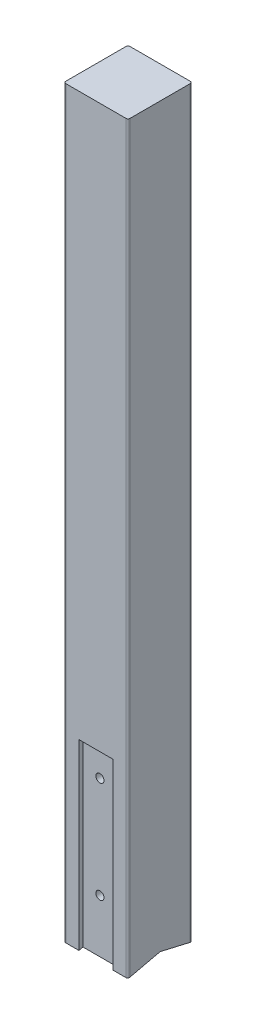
from build123d import *

# Parameters (mm, degrees)
SKETCH3_W                      = 95
SKETCH3_H                      = 95
EXTRUDE_L_NGD_DEPTH            = 1100
CUT_SKRUVH_L_REACH             = 1104.049
SKETCH5_R                      = 6
CUT_SKRUVH_L_DIRECTION_2_REACH = 1104.049
CUT_LUTANDE_BOTTEN_DEPTH       = 1103.049227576
CUT_LUTANDE_BOTTEN_DEPTH_BACK  = 1103.049227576
FILLET_KANTER_R                = 3
SKETCH8_W                      = 50
SKETCH8_H                      = 6
CUT_URTAG_PLATTST_L_DEPTH      = 270


with BuildPart() as part:
    # Sketch3 → Extrude l_ngd (new body)
    with BuildSketch(Plane(origin=(0, 0, 0), x_dir=(1, 0, 0), z_dir=(0, 1, 0))):
        Rectangle(SKETCH3_W, SKETCH3_H)
    extrude(amount=EXTRUDE_L_NGD_DEPTH)

    # Sketch5 → Cut skruvh_l (cut, up to next)
    with BuildSketch(Plane.XY, mode=Mode.PRIVATE) as cut_skruvh_l_sk1:
        with Locations(Location((0, 230, 0), (0, 0, 180))):
            Circle(SKETCH5_R)
    cut_skruvh_l_tool1 = extrude(cut_skruvh_l_sk1.sketch, amount=-CUT_SKRUVH_L_REACH, mode=Mode.PRIVATE) & part.part
    # Sketch5 → Cut skruvh_l (cut, up to next)
    with BuildSketch(Plane.XY, mode=Mode.PRIVATE) as cut_skruvh_l_sk2:
        with Locations(Location((0, 80, 0), (0, 0, 180))):
            Circle(SKETCH5_R)
    cut_skruvh_l_tool2 = extrude(cut_skruvh_l_sk2.sketch, amount=-CUT_SKRUVH_L_REACH, mode=Mode.PRIVATE) & part.part
    add(cut_skruvh_l_tool1.solids().sort_by_distance((0, 230, 0))[0], mode=Mode.SUBTRACT)
    add(cut_skruvh_l_tool2.solids().sort_by_distance((0, 80, 0))[0], mode=Mode.SUBTRACT)

    # Sketch5 → Cut skruvh_l direction 2 (cut, up to next)
    with BuildSketch(Plane.XY, mode=Mode.PRIVATE) as cut_skruvh_l_direction_2_sk1:
        with Locations(Location((0, 230, 0), (0, 0, 180))):
            Circle(SKETCH5_R)
    cut_skruvh_l_direction_2_tool1 = extrude(cut_skruvh_l_direction_2_sk1.sketch, amount=CUT_SKRUVH_L_DIRECTION_2_REACH, mode=Mode.PRIVATE) & part.part
    # Sketch5 → Cut skruvh_l direction 2 (cut, up to next)
    with BuildSketch(Plane.XY, mode=Mode.PRIVATE) as cut_skruvh_l_direction_2_sk2:
        with Locations(Location((0, 80, 0), (0, 0, 180))):
            Circle(SKETCH5_R)
    cut_skruvh_l_direction_2_tool2 = extrude(cut_skruvh_l_direction_2_sk2.sketch, amount=CUT_SKRUVH_L_DIRECTION_2_REACH, mode=Mode.PRIVATE) & part.part
    add(cut_skruvh_l_direction_2_tool1.solids().sort_by_distance((0, 230, 0))[0], mode=Mode.SUBTRACT)
    add(cut_skruvh_l_direction_2_tool2.solids().sort_by_distance((0, 80, 0))[0], mode=Mode.SUBTRACT)

    # Sketch6 → Cut lutande botten (cut, two sides: drawn at the far end of the back side and taken through both)
    with BuildSketch(Plane(origin=(0, 0, 0), x_dir=(0, 0, -1), z_dir=(1, 0, 0)).offset(-CUT_LUTANDE_BOTTEN_DEPTH_BACK)):
        Polygon((2208.500106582, -500.442129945), (47.5, 0), (0, 11), (-47.5, 0), (-2208.500106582, -500.442129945), (-2208.500106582, -4936.820736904), (2208.500106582, -4936.820736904), align=None)
    extrude(amount=CUT_LUTANDE_BOTTEN_DEPTH + CUT_LUTANDE_BOTTEN_DEPTH_BACK, mode=Mode.SUBTRACT)

    # Fillet kanter
    fillet_kanter_edges = [part.edges().sort_by_distance(p)[0] for p in [
        (47.5, 550, -47.5),
        (47.5, 550, 47.5),
        (-47.5, 550, 47.5),
        (-47.5, 550, -47.5),
    ]]
    fillet(fillet_kanter_edges, radius=FILLET_KANTER_R)

    # Sketch8 → Cut urtag plattst_l (cut)
    with BuildSketch(Plane(origin=(0, 0, 47.5), x_dir=(1, 0, 0), z_dir=(0, 1, 0))):
        with Locations((0, 3)):
            Rectangle(SKETCH8_W, SKETCH8_H)
        with Locations((0, 92)):
            Rectangle(SKETCH8_W, SKETCH8_H)
    extrude(amount=CUT_URTAG_PLATTST_L_DEPTH, mode=Mode.SUBTRACT)


solid = part.part
